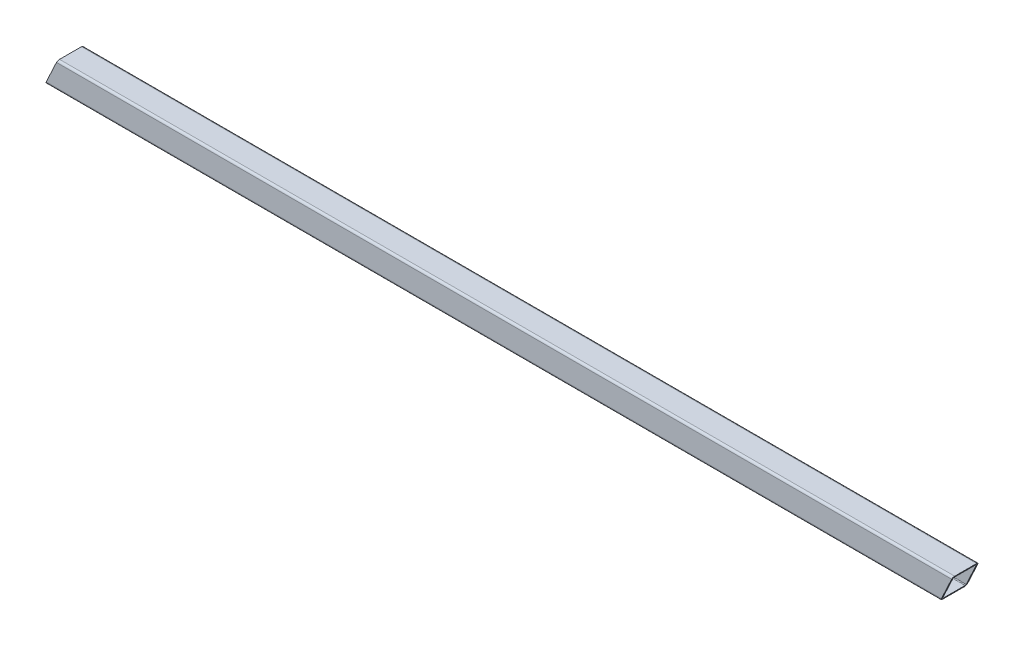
ISO-10303-21;
HEADER;
FILE_DESCRIPTION(('STEP AP214'),'2;1');
FILE_NAME('part.step','',(''),(''),'','','');
FILE_SCHEMA(('AUTOMOTIVE_DESIGN { 1 0 10303 214 1 1 1 1 }'));
ENDSEC;
DATA;
#1=APPLICATION_CONTEXT('core data for automotive mechanical design processes');
#2=APPLICATION_PROTOCOL_DEFINITION('international standard','automotive_design',2000,#1);
#3=PRODUCT_CONTEXT('',#1,'mechanical');
#4=PRODUCT('Part','Part','',(#3));
#5=PRODUCT_RELATED_PRODUCT_CATEGORY('part','',(#4));
#6=PRODUCT_DEFINITION_FORMATION('','',#4);
#7=PRODUCT_DEFINITION_CONTEXT('part definition',#1,'design');
#8=PRODUCT_DEFINITION('design','',#6,#7);
#9=PRODUCT_DEFINITION_SHAPE('','',#8);
#10=(LENGTH_UNIT() NAMED_UNIT(*) SI_UNIT(.MILLI.,.METRE.));
#11=(NAMED_UNIT(*) PLANE_ANGLE_UNIT() SI_UNIT($,.RADIAN.));
#12=(NAMED_UNIT(*) SI_UNIT($,.STERADIAN.) SOLID_ANGLE_UNIT());
#13=UNCERTAINTY_MEASURE_WITH_UNIT(LENGTH_MEASURE(1.E-05),#10,'distance_accuracy_value','');
#14=(GEOMETRIC_REPRESENTATION_CONTEXT(3) GLOBAL_UNCERTAINTY_ASSIGNED_CONTEXT((#13)) GLOBAL_UNIT_ASSIGNED_CONTEXT((#10,
#11,#12)) REPRESENTATION_CONTEXT('',''));
#15=CARTESIAN_POINT('',(0.,0.,0.));
#16=DIRECTION('',(0.,0.,1.));
#17=DIRECTION('',(1.,0.,0.));
#18=AXIS2_PLACEMENT_3D('',#15,#16,#17);
#19=CARTESIAN_POINT('',(1320.8,10.541,21.209));
#20=DIRECTION('',(-1.,0.,0.));
#21=DIRECTION('',(0.,0.,1.));
#22=AXIS2_PLACEMENT_3D('',#19,#20,#21);
#23=CYLINDRICAL_SURFACE('',#22,1.016);
#24=DIRECTION('',(-1.,0.,0.));
#25=VECTOR('',#24,1.);
#26=CARTESIAN_POINT('',(1320.8,9.525,21.209));
#27=LINE('',#26,#25);
#28=CARTESIAN_POINT('',(933.622737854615,9.525,21.209));
#29=VERTEX_POINT('',#28);
#30=CARTESIAN_POINT('',(499.222851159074,9.525,21.209));
#31=VERTEX_POINT('',#30);
#32=EDGE_CURVE('E169',#29,#31,#27,.T.);
#33=ORIENTED_EDGE('',*,*,#32,.F.);
#34=CARTESIAN_POINT('',(934.0965064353,10.541,21.209));
#35=DIRECTION('',(-0.906307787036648,0.422618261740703,0.));
#36=DIRECTION('',(-0.422618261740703,-0.906307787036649,0.));
#37=AXIS2_PLACEMENT_3D('',#34,#35,#36);
#38=ELLIPSE('',#37,1.12103196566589,1.016);
#39=CARTESIAN_POINT('',(934.0965064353,10.541,22.225));
#40=VERTEX_POINT('',#39);
#41=EDGE_CURVE('E157',#29,#40,#38,.T.);
#42=ORIENTED_EDGE('',*,*,#41,.T.);
#43=DIRECTION('',(-1.,0.,0.));
#44=VECTOR('',#43,1.);
#45=CARTESIAN_POINT('',(1320.8,10.541,22.225));
#46=LINE('',#45,#44);
#47=CARTESIAN_POINT('',(499.69661973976,10.541,22.225));
#48=VERTEX_POINT('',#47);
#49=EDGE_CURVE('E167',#40,#48,#46,.T.);
#50=ORIENTED_EDGE('',*,*,#49,.T.);
#51=CARTESIAN_POINT('',(499.69661973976,10.541,21.209));
#52=DIRECTION('',(0.906307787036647,-0.422618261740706,0.));
#53=DIRECTION('',(-0.422618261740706,-0.906307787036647,0.));
#54=AXIS2_PLACEMENT_3D('',#51,#52,#53);
#55=ELLIPSE('',#54,1.1210319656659,1.016);
#56=EDGE_CURVE('E197',#48,#31,#55,.T.);
#57=ORIENTED_EDGE('',*,*,#56,.T.);
#58=EDGE_LOOP('',(#33,#42,#50,#57));
#59=FACE_BOUND('',#58,.T.);
#60=ADVANCED_FACE('F45',(#59),#23,.T.);
#61=CARTESIAN_POINT('',(1320.8,9.525,21.209));
#62=DIRECTION('',(0.,1.,0.));
#63=DIRECTION('',(0.,0.,1.));
#64=AXIS2_PLACEMENT_3D('',#61,#62,#63);
#65=PLANE('',#64);
#66=DIRECTION('',(-1.,0.,0.));
#67=VECTOR('',#66,1.);
#68=CARTESIAN_POINT('',(1320.8,9.525,10.541));
#69=LINE('',#68,#67);
#70=CARTESIAN_POINT('',(933.622737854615,9.525,10.541));
#71=VERTEX_POINT('',#70);
#72=CARTESIAN_POINT('',(499.222851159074,9.525,10.541));
#73=VERTEX_POINT('',#72);
#74=EDGE_CURVE('E186',#71,#73,#69,.T.);
#75=ORIENTED_EDGE('',*,*,#74,.F.);
#76=DIRECTION('',(0.,0.,1.));
#77=VECTOR('',#76,1.);
#78=CARTESIAN_POINT('',(933.622737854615,9.525,21.209));
#79=LINE('',#78,#77);
#80=EDGE_CURVE('E171',#71,#29,#79,.T.);
#81=ORIENTED_EDGE('',*,*,#80,.T.);
#82=ORIENTED_EDGE('',*,*,#32,.T.);
#83=DIRECTION('',(0.,0.,-1.));
#84=VECTOR('',#83,1.);
#85=CARTESIAN_POINT('',(499.222851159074,9.525,21.209));
#86=LINE('',#85,#84);
#87=EDGE_CURVE('E219',#31,#73,#86,.T.);
#88=ORIENTED_EDGE('',*,*,#87,.T.);
#89=EDGE_LOOP('',(#75,#81,#82,#88));
#90=FACE_BOUND('',#89,.T.);
#91=ADVANCED_FACE('F218',(#90),#65,.F.);
#92=CARTESIAN_POINT('',(1320.8,10.541,10.541));
#93=DIRECTION('',(-1.,0.,0.));
#94=DIRECTION('',(0.,0.,1.));
#95=AXIS2_PLACEMENT_3D('',#92,#93,#94);
#96=CYLINDRICAL_SURFACE('',#95,1.016);
#97=DIRECTION('',(-1.,0.,0.));
#98=VECTOR('',#97,1.);
#99=CARTESIAN_POINT('',(1320.8,10.541,9.52499999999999));
#100=LINE('',#99,#98);
#101=CARTESIAN_POINT('',(934.0965064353,10.541,9.52499999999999));
#102=VERTEX_POINT('',#101);
#103=CARTESIAN_POINT('',(499.69661973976,10.5409999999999,9.52499999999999));
#104=VERTEX_POINT('',#103);
#105=EDGE_CURVE('E188',#102,#104,#100,.T.);
#106=ORIENTED_EDGE('',*,*,#105,.F.);
#107=CARTESIAN_POINT('',(934.0965064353,10.541,10.541));
#108=DIRECTION('',(-0.906307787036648,0.422618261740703,0.));
#109=DIRECTION('',(-0.422618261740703,-0.906307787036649,0.));
#110=AXIS2_PLACEMENT_3D('',#107,#108,#109);
#111=ELLIPSE('',#110,1.12103196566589,1.016);
#112=EDGE_CURVE('E262',#102,#71,#111,.T.);
#113=ORIENTED_EDGE('',*,*,#112,.T.);
#114=ORIENTED_EDGE('',*,*,#74,.T.);
#115=CARTESIAN_POINT('',(499.69661973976,10.541,10.541));
#116=DIRECTION('',(0.906307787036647,-0.422618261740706,0.));
#117=DIRECTION('',(-0.422618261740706,-0.906307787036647,0.));
#118=AXIS2_PLACEMENT_3D('',#115,#116,#117);
#119=ELLIPSE('',#118,1.1210319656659,1.016);
#120=EDGE_CURVE('E225',#73,#104,#119,.T.);
#121=ORIENTED_EDGE('',*,*,#120,.T.);
#122=EDGE_LOOP('',(#106,#113,#114,#121));
#123=FACE_BOUND('',#122,.T.);
#124=ADVANCED_FACE('F291',(#123),#96,.T.);
#125=CARTESIAN_POINT('',(1320.8,10.541,9.52499999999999));
#126=DIRECTION('',(0.,0.,1.));
#127=DIRECTION('',(1.,0.,0.));
#128=AXIS2_PLACEMENT_3D('',#125,#126,#127);
#129=PLANE('',#128);
#130=DIRECTION('',(-1.,0.,0.));
#131=VECTOR('',#130,1.);
#132=CARTESIAN_POINT('',(1320.8,21.209,9.52499999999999));
#133=LINE('',#132,#131);
#134=CARTESIAN_POINT('',(939.071076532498,21.209,9.52499999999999));
#135=VERTEX_POINT('',#134);
#136=CARTESIAN_POINT('',(504.671189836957,21.209,9.52499999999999));
#137=VERTEX_POINT('',#136);
#138=EDGE_CURVE('E190',#135,#137,#133,.T.);
#139=ORIENTED_EDGE('',*,*,#138,.F.);
#140=DIRECTION('',(-0.422618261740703,-0.906307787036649,0.));
#141=VECTOR('',#140,1.);
#142=CARTESIAN_POINT('',(927.702443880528,-3.17111139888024,9.52499999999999));
#143=LINE('',#142,#141);
#144=EDGE_CURVE('E162',#135,#102,#143,.T.);
#145=ORIENTED_EDGE('',*,*,#144,.T.);
#146=ORIENTED_EDGE('',*,*,#105,.T.);
#147=DIRECTION('',(0.422618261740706,0.906307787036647,0.));
#148=VECTOR('',#147,1.);
#149=CARTESIAN_POINT('',(497.187439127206,5.16004481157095,9.52499999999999));
#150=LINE('',#149,#148);
#151=EDGE_CURVE('E257',#104,#137,#150,.T.);
#152=ORIENTED_EDGE('',*,*,#151,.T.);
#153=EDGE_LOOP('',(#139,#145,#146,#152));
#154=FACE_BOUND('',#153,.T.);
#155=ADVANCED_FACE('F289',(#154),#129,.F.);
#156=CARTESIAN_POINT('',(1320.8,21.209,10.541));
#157=DIRECTION('',(-1.,0.,0.));
#158=DIRECTION('',(0.,0.,1.));
#159=AXIS2_PLACEMENT_3D('',#156,#157,#158);
#160=CYLINDRICAL_SURFACE('',#159,1.016);
#161=DIRECTION('',(-1.,0.,0.));
#162=VECTOR('',#161,1.);
#163=CARTESIAN_POINT('',(1320.8,22.225,10.541));
#164=LINE('',#163,#162);
#165=CARTESIAN_POINT('',(939.544845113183,22.225,10.541));
#166=VERTEX_POINT('',#165);
#167=CARTESIAN_POINT('',(505.144958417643,22.225,10.541));
#168=VERTEX_POINT('',#167);
#169=EDGE_CURVE('E192',#166,#168,#164,.T.);
#170=ORIENTED_EDGE('',*,*,#169,.F.);
#171=CARTESIAN_POINT('',(939.071076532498,21.209,10.541));
#172=DIRECTION('',(-0.906307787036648,0.422618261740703,0.));
#173=DIRECTION('',(-0.422618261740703,-0.906307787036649,0.));
#174=AXIS2_PLACEMENT_3D('',#171,#172,#173);
#175=ELLIPSE('',#174,1.12103196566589,1.016);
#176=EDGE_CURVE('E265',#166,#135,#175,.T.);
#177=ORIENTED_EDGE('',*,*,#176,.T.);
#178=ORIENTED_EDGE('',*,*,#138,.T.);
#179=CARTESIAN_POINT('',(504.671189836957,21.209,10.541));
#180=DIRECTION('',(0.906307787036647,-0.422618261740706,0.));
#181=DIRECTION('',(-0.422618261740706,-0.906307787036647,0.));
#182=AXIS2_PLACEMENT_3D('',#179,#180,#181);
#183=ELLIPSE('',#182,1.1210319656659,1.016);
#184=EDGE_CURVE('E229',#137,#168,#183,.T.);
#185=ORIENTED_EDGE('',*,*,#184,.T.);
#186=EDGE_LOOP('',(#170,#177,#178,#185));
#187=FACE_BOUND('',#186,.T.);
#188=ADVANCED_FACE('F298',(#187),#160,.T.);
#189=CARTESIAN_POINT('',(1320.8,22.225,10.541));
#190=DIRECTION('',(0.,-1.,0.));
#191=DIRECTION('',(0.,0.,-1.));
#192=AXIS2_PLACEMENT_3D('',#189,#190,#191);
#193=PLANE('',#192);
#194=DIRECTION('',(-1.,0.,0.));
#195=VECTOR('',#194,1.);
#196=CARTESIAN_POINT('',(1320.8,22.225,21.209));
#197=LINE('',#196,#195);
#198=CARTESIAN_POINT('',(939.544845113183,22.225,21.209));
#199=VERTEX_POINT('',#198);
#200=CARTESIAN_POINT('',(505.144958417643,22.225,21.209));
#201=VERTEX_POINT('',#200);
#202=EDGE_CURVE('E179',#199,#201,#197,.T.);
#203=ORIENTED_EDGE('',*,*,#202,.F.);
#204=DIRECTION('',(0.,0.,-1.));
#205=VECTOR('',#204,1.);
#206=CARTESIAN_POINT('',(939.544845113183,22.225,10.541));
#207=LINE('',#206,#205);
#208=EDGE_CURVE('E268',#199,#166,#207,.T.);
#209=ORIENTED_EDGE('',*,*,#208,.T.);
#210=ORIENTED_EDGE('',*,*,#169,.T.);
#211=DIRECTION('',(0.,0.,1.));
#212=VECTOR('',#211,1.);
#213=CARTESIAN_POINT('',(505.144958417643,22.225,10.5409999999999));
#214=LINE('',#213,#212);
#215=EDGE_CURVE('E232',#168,#201,#214,.T.);
#216=ORIENTED_EDGE('',*,*,#215,.T.);
#217=EDGE_LOOP('',(#203,#209,#210,#216));
#218=FACE_BOUND('',#217,.T.);
#219=ADVANCED_FACE('F389',(#218),#193,.F.);
#220=CARTESIAN_POINT('',(1320.8,21.209,21.209));
#221=DIRECTION('',(-1.,0.,0.));
#222=DIRECTION('',(0.,0.,1.));
#223=AXIS2_PLACEMENT_3D('',#220,#221,#222);
#224=CYLINDRICAL_SURFACE('',#223,1.016);
#225=DIRECTION('',(-1.,0.,0.));
#226=VECTOR('',#225,1.);
#227=CARTESIAN_POINT('',(1320.8,21.209,22.225));
#228=LINE('',#227,#226);
#229=CARTESIAN_POINT('',(939.071076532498,21.209,22.225));
#230=VERTEX_POINT('',#229);
#231=CARTESIAN_POINT('',(504.671189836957,21.209,22.225));
#232=VERTEX_POINT('',#231);
#233=EDGE_CURVE('E176',#230,#232,#228,.T.);
#234=ORIENTED_EDGE('',*,*,#233,.F.);
#235=CARTESIAN_POINT('',(939.071076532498,21.209,21.209));
#236=DIRECTION('',(-0.906307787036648,0.422618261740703,0.));
#237=DIRECTION('',(-0.422618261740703,-0.906307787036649,0.));
#238=AXIS2_PLACEMENT_3D('',#235,#236,#237);
#239=ELLIPSE('',#238,1.12103196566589,1.016);
#240=EDGE_CURVE('E60',#230,#199,#239,.T.);
#241=ORIENTED_EDGE('',*,*,#240,.T.);
#242=ORIENTED_EDGE('',*,*,#202,.T.);
#243=CARTESIAN_POINT('',(504.671189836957,21.209,21.209));
#244=DIRECTION('',(0.906307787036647,-0.422618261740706,0.));
#245=DIRECTION('',(-0.422618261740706,-0.906307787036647,0.));
#246=AXIS2_PLACEMENT_3D('',#243,#244,#245);
#247=ELLIPSE('',#246,1.12103196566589,1.016);
#248=EDGE_CURVE('E235',#201,#232,#247,.T.);
#249=ORIENTED_EDGE('',*,*,#248,.T.);
#250=EDGE_LOOP('',(#234,#241,#242,#249));
#251=FACE_BOUND('',#250,.T.);
#252=ADVANCED_FACE('F381',(#251),#224,.T.);
#253=CARTESIAN_POINT('',(1320.8,21.209,22.225));
#254=DIRECTION('',(0.,0.,-1.));
#255=DIRECTION('',(0.,1.,0.));
#256=AXIS2_PLACEMENT_3D('',#253,#254,#255);
#257=PLANE('',#256);
#258=ORIENTED_EDGE('',*,*,#49,.F.);
#259=DIRECTION('',(-0.422618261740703,-0.906307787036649,0.));
#260=VECTOR('',#259,1.);
#261=CARTESIAN_POINT('',(927.702443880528,-3.17111139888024,22.225));
#262=LINE('',#261,#260);
#263=EDGE_CURVE('E154',#230,#40,#262,.T.);
#264=ORIENTED_EDGE('',*,*,#263,.F.);
#265=ORIENTED_EDGE('',*,*,#233,.T.);
#266=DIRECTION('',(0.422618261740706,0.906307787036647,0.));
#267=VECTOR('',#266,1.);
#268=CARTESIAN_POINT('',(497.187439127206,5.16004481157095,22.225));
#269=LINE('',#268,#267);
#270=EDGE_CURVE('E170',#48,#232,#269,.T.);
#271=ORIENTED_EDGE('',*,*,#270,.F.);
#272=EDGE_LOOP('',(#258,#264,#265,#271));
#273=FACE_BOUND('',#272,.T.);
#274=ADVANCED_FACE('F174',(#273),#257,.F.);
#275=CARTESIAN_POINT('',(1320.8,10.541,10.541));
#276=DIRECTION('',(-1.,0.,0.));
#277=DIRECTION('',(0.,0.,1.));
#278=AXIS2_PLACEMENT_3D('',#275,#276,#277);
#279=CYLINDRICAL_SURFACE('',#278,0.3556);
#280=CARTESIAN_POINT('',(934.0965064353,10.541,10.541));
#281=DIRECTION('',(-0.906307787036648,0.422618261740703,0.));
#282=DIRECTION('',(-0.422618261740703,-0.906307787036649,0.));
#283=AXIS2_PLACEMENT_3D('',#280,#281,#282);
#284=ELLIPSE('',#283,0.392361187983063,0.3556);
#285=CARTESIAN_POINT('',(934.0965064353,10.541,10.1854));
#286=VERTEX_POINT('',#285);
#287=CARTESIAN_POINT('',(933.93068743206,10.1854,10.541));
#288=VERTEX_POINT('',#287);
#289=EDGE_CURVE('E67',#286,#288,#284,.T.);
#290=ORIENTED_EDGE('',*,*,#289,.F.);
#291=DIRECTION('',(-1.,0.,0.));
#292=VECTOR('',#291,1.);
#293=CARTESIAN_POINT('',(1320.8,10.541,10.1854));
#294=LINE('',#293,#292);
#295=CARTESIAN_POINT('',(499.69661973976,10.541,10.1854));
#296=VERTEX_POINT('',#295);
#297=EDGE_CURVE('E177',#286,#296,#294,.T.);
#298=ORIENTED_EDGE('',*,*,#297,.T.);
#299=CARTESIAN_POINT('',(499.69661973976,10.541,10.541));
#300=DIRECTION('',(0.906307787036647,-0.422618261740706,0.));
#301=DIRECTION('',(-0.422618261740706,-0.906307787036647,0.));
#302=AXIS2_PLACEMENT_3D('',#299,#300,#301);
#303=ELLIPSE('',#302,0.392361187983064,0.3556);
#304=CARTESIAN_POINT('',(499.53080073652,10.1854,10.541));
#305=VERTEX_POINT('',#304);
#306=EDGE_CURVE('E238',#305,#296,#303,.T.);
#307=ORIENTED_EDGE('',*,*,#306,.F.);
#308=DIRECTION('',(-1.,0.,0.));
#309=VECTOR('',#308,1.);
#310=CARTESIAN_POINT('',(1320.8,10.1854,10.541));
#311=LINE('',#310,#309);
#312=EDGE_CURVE('E195',#288,#305,#311,.T.);
#313=ORIENTED_EDGE('',*,*,#312,.F.);
#314=EDGE_LOOP('',(#290,#298,#307,#313));
#315=FACE_BOUND('',#314,.T.);
#316=ADVANCED_FACE('F366',(#315),#279,.F.);
#317=CARTESIAN_POINT('',(1320.8,10.541,10.1854));
#318=DIRECTION('',(0.,0.,1.));
#319=DIRECTION('',(1.,0.,0.));
#320=AXIS2_PLACEMENT_3D('',#317,#318,#319);
#321=PLANE('',#320);
#322=DIRECTION('',(-0.422618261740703,-0.906307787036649,0.));
#323=VECTOR('',#322,1.);
#324=CARTESIAN_POINT('',(1003.16414607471,158.657031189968,10.1854));
#325=LINE('',#324,#323);
#326=CARTESIAN_POINT('',(939.071076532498,21.209,10.1854));
#327=VERTEX_POINT('',#326);
#328=EDGE_CURVE('E273',#327,#286,#325,.T.);
#329=ORIENTED_EDGE('',*,*,#328,.F.);
#330=DIRECTION('',(-1.,0.,0.));
#331=VECTOR('',#330,1.);
#332=CARTESIAN_POINT('',(1320.8,21.209,10.1854));
#333=LINE('',#332,#331);
#334=CARTESIAN_POINT('',(504.671189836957,21.209,10.1854));
#335=VERTEX_POINT('',#334);
#336=EDGE_CURVE('E181',#327,#335,#333,.T.);
#337=ORIENTED_EDGE('',*,*,#336,.T.);
#338=DIRECTION('',(0.422618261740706,0.906307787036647,0.));
#339=VECTOR('',#338,1.);
#340=CARTESIAN_POINT('',(646.350770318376,325.041840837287,10.1854));
#341=LINE('',#340,#339);
#342=EDGE_CURVE('E240',#296,#335,#341,.T.);
#343=ORIENTED_EDGE('',*,*,#342,.F.);
#344=ORIENTED_EDGE('',*,*,#297,.F.);
#345=EDGE_LOOP('',(#329,#337,#343,#344));
#346=FACE_BOUND('',#345,.T.);
#347=ADVANCED_FACE('F358',(#346),#321,.T.);
#348=CARTESIAN_POINT('',(1320.8,21.209,10.541));
#349=DIRECTION('',(-1.,0.,0.));
#350=DIRECTION('',(0.,0.,1.));
#351=AXIS2_PLACEMENT_3D('',#348,#349,#350);
#352=CYLINDRICAL_SURFACE('',#351,0.3556);
#353=CARTESIAN_POINT('',(939.071076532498,21.209,10.541));
#354=DIRECTION('',(-0.906307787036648,0.422618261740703,0.));
#355=DIRECTION('',(-0.422618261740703,-0.906307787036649,0.));
#356=AXIS2_PLACEMENT_3D('',#353,#354,#355);
#357=ELLIPSE('',#356,0.392361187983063,0.3556);
#358=CARTESIAN_POINT('',(939.236895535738,21.5646,10.541));
#359=VERTEX_POINT('',#358);
#360=EDGE_CURVE('E275',#359,#327,#357,.T.);
#361=ORIENTED_EDGE('',*,*,#360,.F.);
#362=DIRECTION('',(-1.,0.,0.));
#363=VECTOR('',#362,1.);
#364=CARTESIAN_POINT('',(1320.8,21.5646,10.541));
#365=LINE('',#364,#363);
#366=CARTESIAN_POINT('',(504.837008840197,21.5646,10.541));
#367=VERTEX_POINT('',#366);
#368=EDGE_CURVE('E200',#359,#367,#365,.T.);
#369=ORIENTED_EDGE('',*,*,#368,.T.);
#370=CARTESIAN_POINT('',(504.671189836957,21.209,10.541));
#371=DIRECTION('',(0.906307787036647,-0.422618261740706,0.));
#372=DIRECTION('',(-0.422618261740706,-0.906307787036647,0.));
#373=AXIS2_PLACEMENT_3D('',#370,#371,#372);
#374=ELLIPSE('',#373,0.392361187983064,0.3556);
#375=EDGE_CURVE('E243',#335,#367,#374,.T.);
#376=ORIENTED_EDGE('',*,*,#375,.F.);
#377=ORIENTED_EDGE('',*,*,#336,.F.);
#378=EDGE_LOOP('',(#361,#369,#376,#377));
#379=FACE_BOUND('',#378,.T.);
#380=ADVANCED_FACE('F350',(#379),#352,.F.);
#381=CARTESIAN_POINT('',(1320.8,21.5646,10.541));
#382=DIRECTION('',(0.,-1.,0.));
#383=DIRECTION('',(0.,0.,-1.));
#384=AXIS2_PLACEMENT_3D('',#381,#382,#383);
#385=PLANE('',#384);
#386=DIRECTION('',(0.,0.,-1.));
#387=VECTOR('',#386,1.);
#388=CARTESIAN_POINT('',(939.236895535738,21.5646,10.541));
#389=LINE('',#388,#387);
#390=CARTESIAN_POINT('',(939.236895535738,21.5646,21.209));
#391=VERTEX_POINT('',#390);
#392=EDGE_CURVE('E277',#391,#359,#389,.T.);
#393=ORIENTED_EDGE('',*,*,#392,.F.);
#394=DIRECTION('',(-1.,0.,0.));
#395=VECTOR('',#394,1.);
#396=CARTESIAN_POINT('',(1320.8,21.5646,21.209));
#397=LINE('',#396,#395);
#398=CARTESIAN_POINT('',(504.837008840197,21.5646,21.209));
#399=VERTEX_POINT('',#398);
#400=EDGE_CURVE('E202',#391,#399,#397,.T.);
#401=ORIENTED_EDGE('',*,*,#400,.T.);
#402=DIRECTION('',(0.,0.,1.));
#403=VECTOR('',#402,1.);
#404=CARTESIAN_POINT('',(504.837008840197,21.5646,10.541));
#405=LINE('',#404,#403);
#406=EDGE_CURVE('E246',#367,#399,#405,.T.);
#407=ORIENTED_EDGE('',*,*,#406,.F.);
#408=ORIENTED_EDGE('',*,*,#368,.F.);
#409=EDGE_LOOP('',(#393,#401,#407,#408));
#410=FACE_BOUND('',#409,.T.);
#411=ADVANCED_FACE('F342',(#410),#385,.T.);
#412=CARTESIAN_POINT('',(1320.8,21.209,21.209));
#413=DIRECTION('',(-1.,0.,0.));
#414=DIRECTION('',(0.,0.,1.));
#415=AXIS2_PLACEMENT_3D('',#412,#413,#414);
#416=CYLINDRICAL_SURFACE('',#415,0.355600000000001);
#417=CARTESIAN_POINT('',(939.071076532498,21.209,21.209));
#418=DIRECTION('',(-0.906307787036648,0.422618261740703,0.));
#419=DIRECTION('',(-0.422618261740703,-0.906307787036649,0.));
#420=AXIS2_PLACEMENT_3D('',#417,#418,#419);
#421=ELLIPSE('',#420,0.392361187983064,0.355600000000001);
#422=CARTESIAN_POINT('',(939.071076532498,21.209,21.5646));
#423=VERTEX_POINT('',#422);
#424=EDGE_CURVE('E279',#423,#391,#421,.T.);
#425=ORIENTED_EDGE('',*,*,#424,.F.);
#426=DIRECTION('',(-1.,0.,0.));
#427=VECTOR('',#426,1.);
#428=CARTESIAN_POINT('',(1320.8,21.209,21.5646));
#429=LINE('',#428,#427);
#430=CARTESIAN_POINT('',(504.671189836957,21.209,21.5646));
#431=VERTEX_POINT('',#430);
#432=EDGE_CURVE('E204',#423,#431,#429,.T.);
#433=ORIENTED_EDGE('',*,*,#432,.T.);
#434=CARTESIAN_POINT('',(504.671189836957,21.209,21.209));
#435=DIRECTION('',(0.906307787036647,-0.422618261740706,0.));
#436=DIRECTION('',(-0.422618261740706,-0.906307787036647,0.));
#437=AXIS2_PLACEMENT_3D('',#434,#435,#436);
#438=ELLIPSE('',#437,0.392361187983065,0.355600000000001);
#439=EDGE_CURVE('E249',#399,#431,#438,.T.);
#440=ORIENTED_EDGE('',*,*,#439,.F.);
#441=ORIENTED_EDGE('',*,*,#400,.F.);
#442=EDGE_LOOP('',(#425,#433,#440,#441));
#443=FACE_BOUND('',#442,.T.);
#444=ADVANCED_FACE('F334',(#443),#416,.F.);
#445=CARTESIAN_POINT('',(1320.8,21.209,21.5646));
#446=DIRECTION('',(0.,0.,-1.));
#447=DIRECTION('',(-1.,0.,0.));
#448=AXIS2_PLACEMENT_3D('',#445,#446,#447);
#449=PLANE('',#448);
#450=DIRECTION('',(0.422618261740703,0.906307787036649,0.));
#451=VECTOR('',#450,1.);
#452=CARTESIAN_POINT('',(1007.2502271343,167.419660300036,21.5646));
#453=LINE('',#452,#451);
#454=CARTESIAN_POINT('',(934.0965064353,10.541,21.5646));
#455=VERTEX_POINT('',#454);
#456=EDGE_CURVE('E281',#455,#423,#453,.T.);
#457=ORIENTED_EDGE('',*,*,#456,.F.);
#458=DIRECTION('',(-1.,0.,0.));
#459=VECTOR('',#458,1.);
#460=CARTESIAN_POINT('',(1320.8,10.541,21.5646));
#461=LINE('',#460,#459);
#462=CARTESIAN_POINT('',(499.69661973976,10.541,21.5646));
#463=VERTEX_POINT('',#462);
#464=EDGE_CURVE('E206',#455,#463,#461,.T.);
#465=ORIENTED_EDGE('',*,*,#464,.T.);
#466=DIRECTION('',(-0.422618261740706,-0.906307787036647,0.));
#467=VECTOR('',#466,1.);
#468=CARTESIAN_POINT('',(650.436851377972,333.804469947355,21.5646));
#469=LINE('',#468,#467);
#470=EDGE_CURVE('E252',#431,#463,#469,.T.);
#471=ORIENTED_EDGE('',*,*,#470,.F.);
#472=ORIENTED_EDGE('',*,*,#432,.F.);
#473=EDGE_LOOP('',(#457,#465,#471,#472));
#474=FACE_BOUND('',#473,.T.);
#475=ADVANCED_FACE('F327',(#474),#449,.T.);
#476=CARTESIAN_POINT('',(1320.8,10.541,21.209));
#477=DIRECTION('',(-1.,0.,0.));
#478=DIRECTION('',(0.,0.,1.));
#479=AXIS2_PLACEMENT_3D('',#476,#477,#478);
#480=CYLINDRICAL_SURFACE('',#479,0.355600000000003);
#481=CARTESIAN_POINT('',(934.0965064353,10.541,21.209));
#482=DIRECTION('',(-0.906307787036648,0.422618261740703,0.));
#483=DIRECTION('',(-0.422618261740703,-0.906307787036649,0.));
#484=AXIS2_PLACEMENT_3D('',#481,#482,#483);
#485=ELLIPSE('',#484,0.392361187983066,0.355600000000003);
#486=CARTESIAN_POINT('',(933.93068743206,10.1854,21.209));
#487=VERTEX_POINT('',#486);
#488=EDGE_CURVE('E283',#487,#455,#485,.T.);
#489=ORIENTED_EDGE('',*,*,#488,.F.);
#490=DIRECTION('',(-1.,0.,0.));
#491=VECTOR('',#490,1.);
#492=CARTESIAN_POINT('',(1320.8,10.1854,21.209));
#493=LINE('',#492,#491);
#494=CARTESIAN_POINT('',(499.53080073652,10.1854,21.209));
#495=VERTEX_POINT('',#494);
#496=EDGE_CURVE('E196',#487,#495,#493,.T.);
#497=ORIENTED_EDGE('',*,*,#496,.T.);
#498=CARTESIAN_POINT('',(499.69661973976,10.541,21.209));
#499=DIRECTION('',(0.906307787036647,-0.422618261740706,0.));
#500=DIRECTION('',(-0.422618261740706,-0.906307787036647,0.));
#501=AXIS2_PLACEMENT_3D('',#498,#499,#500);
#502=ELLIPSE('',#501,0.392361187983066,0.355600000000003);
#503=EDGE_CURVE('E255',#463,#495,#502,.T.);
#504=ORIENTED_EDGE('',*,*,#503,.F.);
#505=ORIENTED_EDGE('',*,*,#464,.F.);
#506=EDGE_LOOP('',(#489,#497,#504,#505));
#507=FACE_BOUND('',#506,.T.);
#508=ADVANCED_FACE('F319',(#507),#480,.F.);
#509=CARTESIAN_POINT('',(1320.8,10.1854,21.209));
#510=DIRECTION('',(0.,1.,0.));
#511=DIRECTION('',(0.,0.,1.));
#512=AXIS2_PLACEMENT_3D('',#509,#510,#511);
#513=PLANE('',#512);
#514=DIRECTION('',(0.,0.,1.));
#515=VECTOR('',#514,1.);
#516=CARTESIAN_POINT('',(933.93068743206,10.1854,21.209));
#517=LINE('',#516,#515);
#518=EDGE_CURVE('E11',#288,#487,#517,.T.);
#519=ORIENTED_EDGE('',*,*,#518,.F.);
#520=ORIENTED_EDGE('',*,*,#312,.T.);
#521=DIRECTION('',(0.,0.,-1.));
#522=VECTOR('',#521,1.);
#523=CARTESIAN_POINT('',(499.53080073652,10.1854,21.209));
#524=LINE('',#523,#522);
#525=EDGE_CURVE('E53',#495,#305,#524,.T.);
#526=ORIENTED_EDGE('',*,*,#525,.F.);
#527=ORIENTED_EDGE('',*,*,#496,.F.);
#528=EDGE_LOOP('',(#519,#520,#526,#527));
#529=FACE_BOUND('',#528,.T.);
#530=ADVANCED_FACE('F47',(#529),#513,.T.);
#531=CARTESIAN_POINT('',(497.187439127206,5.16004481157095,9.52499999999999));
#532=DIRECTION('',(0.906307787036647,-0.422618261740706,0.));
#533=DIRECTION('',(0.422618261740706,0.906307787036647,0.));
#534=AXIS2_PLACEMENT_3D('',#531,#532,#533);
#535=PLANE('',#534);
#536=ORIENTED_EDGE('',*,*,#306,.T.);
#537=ORIENTED_EDGE('',*,*,#342,.T.);
#538=ORIENTED_EDGE('',*,*,#375,.T.);
#539=ORIENTED_EDGE('',*,*,#406,.T.);
#540=ORIENTED_EDGE('',*,*,#439,.T.);
#541=ORIENTED_EDGE('',*,*,#470,.T.);
#542=ORIENTED_EDGE('',*,*,#503,.T.);
#543=ORIENTED_EDGE('',*,*,#525,.T.);
#544=EDGE_LOOP('',(#536,#537,#538,#539,#540,#541,#542,#543));
#545=FACE_BOUND('',#544,.T.);
#546=ORIENTED_EDGE('',*,*,#270,.T.);
#547=ORIENTED_EDGE('',*,*,#248,.F.);
#548=ORIENTED_EDGE('',*,*,#215,.F.);
#549=ORIENTED_EDGE('',*,*,#184,.F.);
#550=ORIENTED_EDGE('',*,*,#151,.F.);
#551=ORIENTED_EDGE('',*,*,#120,.F.);
#552=ORIENTED_EDGE('',*,*,#87,.F.);
#553=ORIENTED_EDGE('',*,*,#56,.F.);
#554=EDGE_LOOP('',(#546,#547,#548,#549,#550,#551,#552,#553));
#555=FACE_BOUND('',#554,.T.);
#556=ADVANCED_FACE('F222',(#545,#555),#535,.F.);
#557=CARTESIAN_POINT('',(927.702443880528,-3.17111139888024,9.52499999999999));
#558=DIRECTION('',(-0.906307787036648,0.422618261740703,0.));
#559=DIRECTION('',(-0.422618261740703,-0.906307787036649,0.));
#560=AXIS2_PLACEMENT_3D('',#557,#558,#559);
#561=PLANE('',#560);
#562=ORIENTED_EDGE('',*,*,#289,.T.);
#563=ORIENTED_EDGE('',*,*,#518,.T.);
#564=ORIENTED_EDGE('',*,*,#488,.T.);
#565=ORIENTED_EDGE('',*,*,#456,.T.);
#566=ORIENTED_EDGE('',*,*,#424,.T.);
#567=ORIENTED_EDGE('',*,*,#392,.T.);
#568=ORIENTED_EDGE('',*,*,#360,.T.);
#569=ORIENTED_EDGE('',*,*,#328,.T.);
#570=EDGE_LOOP('',(#562,#563,#564,#565,#566,#567,#568,#569));
#571=FACE_BOUND('',#570,.T.);
#572=ORIENTED_EDGE('',*,*,#80,.F.);
#573=ORIENTED_EDGE('',*,*,#112,.F.);
#574=ORIENTED_EDGE('',*,*,#144,.F.);
#575=ORIENTED_EDGE('',*,*,#176,.F.);
#576=ORIENTED_EDGE('',*,*,#208,.F.);
#577=ORIENTED_EDGE('',*,*,#240,.F.);
#578=ORIENTED_EDGE('',*,*,#263,.T.);
#579=ORIENTED_EDGE('',*,*,#41,.F.);
#580=EDGE_LOOP('',(#572,#573,#574,#575,#576,#577,#578,#579));
#581=FACE_BOUND('',#580,.T.);
#582=ADVANCED_FACE('F156',(#571,#581),#561,.F.);
#583=CLOSED_SHELL('',(#60,#91,#124,#155,#188,#219,#252,#274,#316,#347,#380,#411,#444,#475,#508,
#530,#556,#582));
#584=MANIFOLD_SOLID_BREP('B2',#583);
#585=ADVANCED_BREP_SHAPE_REPRESENTATION('',(#18,#584),#14);
#586=SHAPE_DEFINITION_REPRESENTATION(#9,#585);
ENDSEC;
END-ISO-10303-21;
